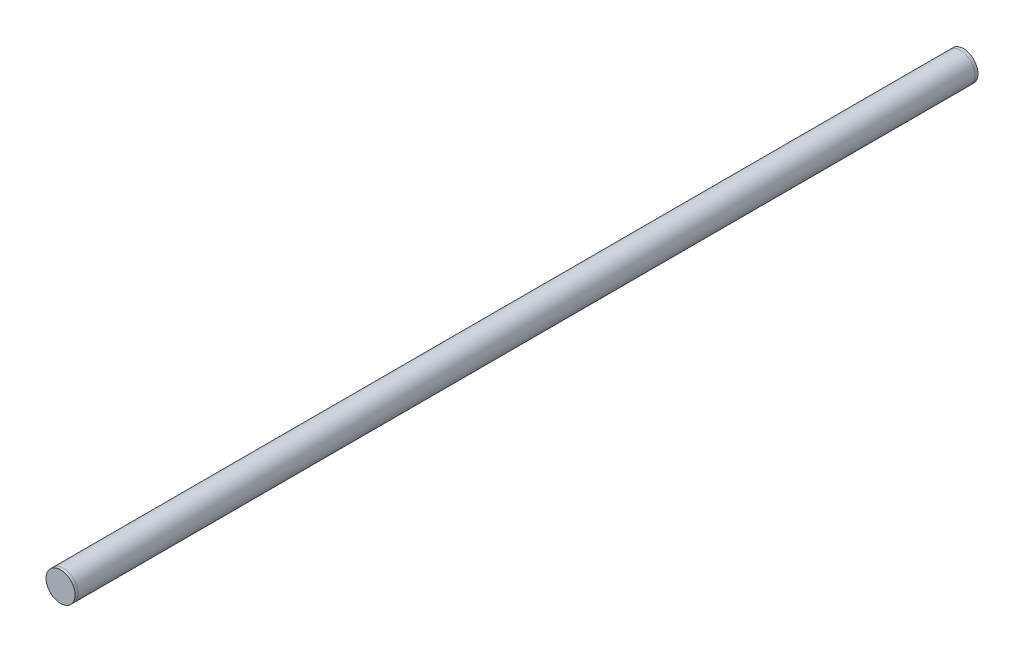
ISO-10303-21;
HEADER;
FILE_DESCRIPTION(('STEP AP214'),'2;1');
FILE_NAME('part.step','',(''),(''),'','','');
FILE_SCHEMA(('AUTOMOTIVE_DESIGN { 1 0 10303 214 1 1 1 1 }'));
ENDSEC;
DATA;
#1=APPLICATION_CONTEXT('core data for automotive mechanical design processes');
#2=APPLICATION_PROTOCOL_DEFINITION('international standard','automotive_design',2000,#1);
#3=PRODUCT_CONTEXT('',#1,'mechanical');
#4=PRODUCT('Part','Part','',(#3));
#5=PRODUCT_RELATED_PRODUCT_CATEGORY('part','',(#4));
#6=PRODUCT_DEFINITION_FORMATION('','',#4);
#7=PRODUCT_DEFINITION_CONTEXT('part definition',#1,'design');
#8=PRODUCT_DEFINITION('design','',#6,#7);
#9=PRODUCT_DEFINITION_SHAPE('','',#8);
#10=(LENGTH_UNIT() NAMED_UNIT(*) SI_UNIT(.MILLI.,.METRE.));
#11=(NAMED_UNIT(*) PLANE_ANGLE_UNIT() SI_UNIT($,.RADIAN.));
#12=(NAMED_UNIT(*) SI_UNIT($,.STERADIAN.) SOLID_ANGLE_UNIT());
#13=UNCERTAINTY_MEASURE_WITH_UNIT(LENGTH_MEASURE(1.E-05),#10,'distance_accuracy_value','');
#14=(GEOMETRIC_REPRESENTATION_CONTEXT(3) GLOBAL_UNCERTAINTY_ASSIGNED_CONTEXT((#13)) GLOBAL_UNIT_ASSIGNED_CONTEXT((#10,
#11,#12)) REPRESENTATION_CONTEXT('',''));
#15=CARTESIAN_POINT('',(0.,0.,0.));
#16=DIRECTION('',(0.,0.,1.));
#17=DIRECTION('',(1.,0.,0.));
#18=AXIS2_PLACEMENT_3D('',#15,#16,#17);
#19=CARTESIAN_POINT('',(0.,0.,787.4));
#20=DIRECTION('',(0.,0.,-1.));
#21=DIRECTION('',(-1.,0.,0.));
#22=AXIS2_PLACEMENT_3D('',#19,#20,#21);
#23=CYLINDRICAL_SURFACE('',#22,12.7);
#24=CARTESIAN_POINT('',(0.,0.,787.4));
#25=DIRECTION('',(0.,0.,1.));
#26=DIRECTION('',(1.,0.,0.));
#27=AXIS2_PLACEMENT_3D('',#24,#25,#26);
#28=CIRCLE('',#27,12.7);
#29=CARTESIAN_POINT('',(12.7,0.,787.4));
#30=VERTEX_POINT('',#29);
#31=EDGE_CURVE('E60',#30,#30,#28,.T.);
#32=ORIENTED_EDGE('',*,*,#31,.F.);
#33=EDGE_LOOP('',(#32));
#34=FACE_BOUND('',#33,.T.);
#35=CARTESIAN_POINT('',(0.,0.,784.86));
#36=DIRECTION('',(0.,0.,-1.));
#37=DIRECTION('',(-1.,0.,0.));
#38=AXIS2_PLACEMENT_3D('',#35,#36,#37);
#39=CIRCLE('',#38,12.7);
#40=CARTESIAN_POINT('',(-12.7,0.,784.86));
#41=VERTEX_POINT('',#40);
#42=EDGE_CURVE('E11',#41,#41,#39,.T.);
#43=ORIENTED_EDGE('',*,*,#42,.F.);
#44=EDGE_LOOP('',(#43));
#45=FACE_BOUND('',#44,.T.);
#46=ADVANCED_FACE('F45',(#34,#45),#23,.T.);
#47=ORIENTED_EDGE('',*,*,#42,.T.);
#48=EDGE_LOOP('',(#47));
#49=FACE_BOUND('',#48,.T.);
#50=CARTESIAN_POINT('',(0.,0.,2.53999999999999));
#51=DIRECTION('',(0.,0.,-1.));
#52=DIRECTION('',(0.,1.,0.));
#53=AXIS2_PLACEMENT_3D('',#50,#51,#52);
#54=CIRCLE('',#53,12.7);
#55=CARTESIAN_POINT('',(0.,12.7,2.53999999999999));
#56=VERTEX_POINT('',#55);
#57=EDGE_CURVE('E53',#56,#56,#54,.T.);
#58=ORIENTED_EDGE('',*,*,#57,.F.);
#59=EDGE_LOOP('',(#58));
#60=FACE_BOUND('',#59,.T.);
#61=ADVANCED_FACE('F85',(#49,#60),#23,.T.);
#62=ORIENTED_EDGE('',*,*,#57,.T.);
#63=EDGE_LOOP('',(#62));
#64=FACE_BOUND('',#63,.T.);
#65=CARTESIAN_POINT('',(0.,0.,0.));
#66=DIRECTION('',(0.,0.,1.));
#67=DIRECTION('',(1.,0.,0.));
#68=AXIS2_PLACEMENT_3D('',#65,#66,#67);
#69=CIRCLE('',#68,12.7);
#70=CARTESIAN_POINT('',(12.7,0.,0.));
#71=VERTEX_POINT('',#70);
#72=EDGE_CURVE('E66',#71,#71,#69,.T.);
#73=ORIENTED_EDGE('',*,*,#72,.T.);
#74=EDGE_LOOP('',(#73));
#75=FACE_BOUND('',#74,.T.);
#76=ADVANCED_FACE('F47',(#64,#75),#23,.T.);
#77=CARTESIAN_POINT('',(0.,0.,787.4));
#78=DIRECTION('',(0.,0.,1.));
#79=DIRECTION('',(1.,0.,0.));
#80=AXIS2_PLACEMENT_3D('',#77,#78,#79);
#81=PLANE('',#80);
#82=ORIENTED_EDGE('',*,*,#31,.T.);
#83=EDGE_LOOP('',(#82));
#84=FACE_BOUND('',#83,.T.);
#85=ADVANCED_FACE('F78',(#84),#81,.T.);
#86=CARTESIAN_POINT('',(0.,0.,0.));
#87=DIRECTION('',(0.,0.,1.));
#88=DIRECTION('',(1.,0.,0.));
#89=AXIS2_PLACEMENT_3D('',#86,#87,#88);
#90=PLANE('',#89);
#91=ORIENTED_EDGE('',*,*,#72,.F.);
#92=EDGE_LOOP('',(#91));
#93=FACE_BOUND('',#92,.T.);
#94=ADVANCED_FACE('F76',(#93),#90,.F.);
#95=CLOSED_SHELL('',(#46,#61,#76,#85,#94));
#96=MANIFOLD_SOLID_BREP('B2',#95);
#97=ADVANCED_BREP_SHAPE_REPRESENTATION('',(#18,#96),#14);
#98=SHAPE_DEFINITION_REPRESENTATION(#9,#97);
ENDSEC;
END-ISO-10303-21;
